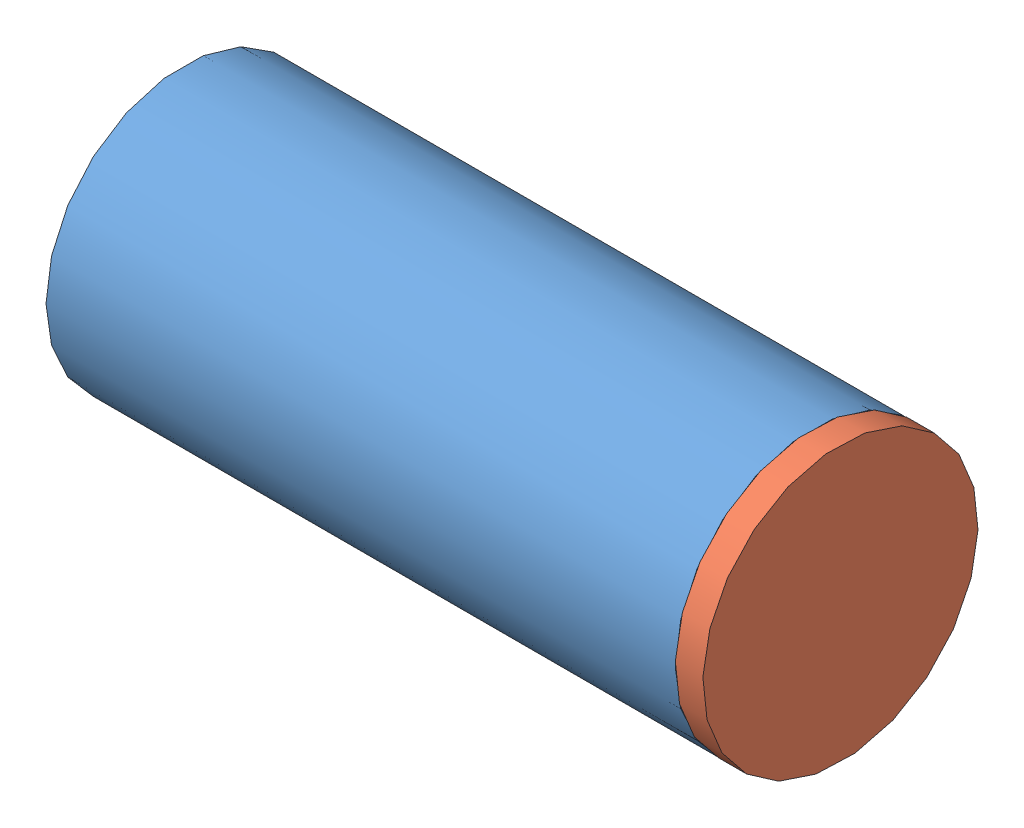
SolidWorks assembly moteur stator rotor.SLDASM, configuration Default (file format 4100). Lengths in mm.
Overall size (16.7 9.14 9.14).
2 component instances, 2 part files, 2 mates.
Components (placement in the parent):
- moteur rotor carter-1: moteur rotor carter.SLDPRT [Default] at origin size (16 7 7)
- moteur rotor bouchon plastique-1: moteur rotor bouchon plastique.SLDPRT [Default] at (16.7 0 0) x (-1 0 0) z (0 -0.924225 -0.381849) size (16.6 7 7)
Mates (geometry in assembly coordinates):
- Coaxiale1: concentric: cylinder of moteur rotor bouchon plastique-1 through (16.7 0 0) axis (1 0 0) radius 3.4; cylinder of moteur rotor carter-1 through (0 0 0) axis (-1 0 0) radius 3.4
- Coïncidente1: coincident anti-aligned: plane of moteur rotor carter-1 through (16 3.5 0) normal (1 0 0); plane of moteur rotor bouchon plastique-1 through (16 1.3365 -3.2348) normal (-1 0 0)
